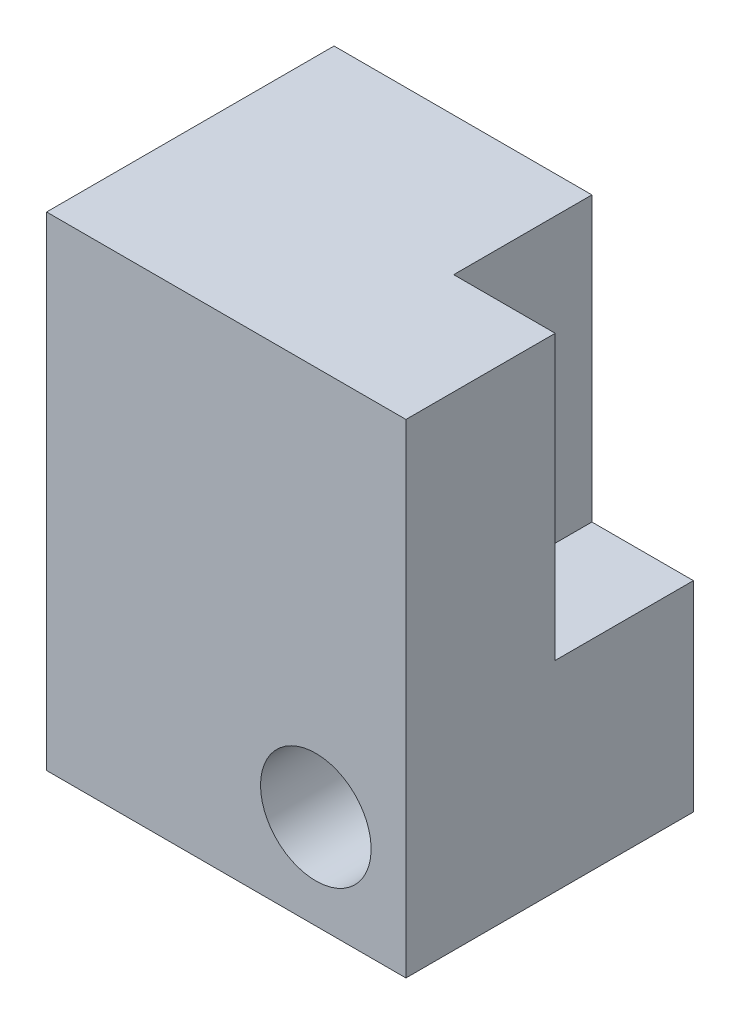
ISO-10303-21;
HEADER;
FILE_DESCRIPTION(('STEP AP214'),'2;1');
FILE_NAME('part.step','',(''),(''),'','','');
FILE_SCHEMA(('AUTOMOTIVE_DESIGN { 1 0 10303 214 1 1 1 1 }'));
ENDSEC;
DATA;
#1=APPLICATION_CONTEXT('core data for automotive mechanical design processes');
#2=APPLICATION_PROTOCOL_DEFINITION('international standard','automotive_design',2000,#1);
#3=PRODUCT_CONTEXT('',#1,'mechanical');
#4=PRODUCT('Part','Part','',(#3));
#5=PRODUCT_RELATED_PRODUCT_CATEGORY('part','',(#4));
#6=PRODUCT_DEFINITION_FORMATION('','',#4);
#7=PRODUCT_DEFINITION_CONTEXT('part definition',#1,'design');
#8=PRODUCT_DEFINITION('design','',#6,#7);
#9=PRODUCT_DEFINITION_SHAPE('','',#8);
#10=(LENGTH_UNIT() NAMED_UNIT(*) SI_UNIT(.MILLI.,.METRE.));
#11=(NAMED_UNIT(*) PLANE_ANGLE_UNIT() SI_UNIT($,.RADIAN.));
#12=(NAMED_UNIT(*) SI_UNIT($,.STERADIAN.) SOLID_ANGLE_UNIT());
#13=UNCERTAINTY_MEASURE_WITH_UNIT(LENGTH_MEASURE(1.E-05),#10,'distance_accuracy_value','');
#14=(GEOMETRIC_REPRESENTATION_CONTEXT(3) GLOBAL_UNCERTAINTY_ASSIGNED_CONTEXT((#13)) GLOBAL_UNIT_ASSIGNED_CONTEXT((#10,
#11,#12)) REPRESENTATION_CONTEXT('',''));
#15=CARTESIAN_POINT('',(0.,0.,0.));
#16=DIRECTION('',(0.,0.,1.));
#17=DIRECTION('',(1.,0.,0.));
#18=AXIS2_PLACEMENT_3D('',#15,#16,#17);
#19=CARTESIAN_POINT('',(0.,0.,104.));
#20=DIRECTION('',(0.,0.,1.));
#21=DIRECTION('',(1.,0.,0.));
#22=AXIS2_PLACEMENT_3D('',#19,#20,#21);
#23=PLANE('',#22);
#24=DIRECTION('',(0.,-1.,0.));
#25=VECTOR('',#24,1.);
#26=CARTESIAN_POINT('',(-130.,-175.,104.));
#27=LINE('',#26,#25);
#28=CARTESIAN_POINT('',(-130.,175.,104.));
#29=VERTEX_POINT('',#28);
#30=CARTESIAN_POINT('',(-130.,-175.,104.));
#31=VERTEX_POINT('',#30);
#32=EDGE_CURVE('E127',#29,#31,#27,.T.);
#33=ORIENTED_EDGE('',*,*,#32,.T.);
#34=DIRECTION('',(1.,0.,0.));
#35=VECTOR('',#34,1.);
#36=CARTESIAN_POINT('',(130.,-175.,104.));
#37=LINE('',#36,#35);
#38=CARTESIAN_POINT('',(130.,-175.,104.));
#39=VERTEX_POINT('',#38);
#40=EDGE_CURVE('E82',#31,#39,#37,.T.);
#41=ORIENTED_EDGE('',*,*,#40,.T.);
#42=DIRECTION('',(0.,1.,0.));
#43=VECTOR('',#42,1.);
#44=CARTESIAN_POINT('',(130.,-175.,104.));
#45=LINE('',#44,#43);
#46=CARTESIAN_POINT('',(130.,175.,104.));
#47=VERTEX_POINT('',#46);
#48=EDGE_CURVE('E140',#39,#47,#45,.T.);
#49=ORIENTED_EDGE('',*,*,#48,.T.);
#50=DIRECTION('',(-1.,0.,0.));
#51=VECTOR('',#50,1.);
#52=CARTESIAN_POINT('',(130.,175.,104.));
#53=LINE('',#52,#51);
#54=EDGE_CURVE('E58',#47,#29,#53,.T.);
#55=ORIENTED_EDGE('',*,*,#54,.T.);
#56=EDGE_LOOP('',(#33,#41,#49,#55));
#57=FACE_BOUND('',#56,.T.);
#58=CARTESIAN_POINT('',(64.7903211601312,-106.77508673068,104.));
#59=DIRECTION('',(0.,0.,1.));
#60=DIRECTION('',(1.,0.,0.));
#61=AXIS2_PLACEMENT_3D('',#58,#59,#60);
#62=CIRCLE('',#61,40.);
#63=CARTESIAN_POINT('',(24.7903211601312,-106.77508673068,104.));
#64=VERTEX_POINT('',#63);
#65=EDGE_CURVE('E147',#64,#64,#62,.T.);
#66=ORIENTED_EDGE('',*,*,#65,.F.);
#67=EDGE_LOOP('',(#66));
#68=FACE_BOUND('',#67,.T.);
#69=ADVANCED_FACE('F34',(#57,#68),#23,.T.);
#70=CARTESIAN_POINT('',(0.,0.,-104.));
#71=DIRECTION('',(0.,0.,1.));
#72=DIRECTION('',(1.,0.,0.));
#73=AXIS2_PLACEMENT_3D('',#70,#71,#72);
#74=PLANE('',#73);
#75=DIRECTION('',(-1.,0.,0.));
#76=VECTOR('',#75,1.);
#77=CARTESIAN_POINT('',(130.,175.,-104.));
#78=LINE('',#77,#76);
#79=CARTESIAN_POINT('',(56.5603151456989,175.,-104.));
#80=VERTEX_POINT('',#79);
#81=CARTESIAN_POINT('',(-130.,175.,-104.));
#82=VERTEX_POINT('',#81);
#83=EDGE_CURVE('E75',#80,#82,#78,.T.);
#84=ORIENTED_EDGE('',*,*,#83,.F.);
#85=DIRECTION('',(0.,1.,0.));
#86=VECTOR('',#85,1.);
#87=CARTESIAN_POINT('',(56.560315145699,-30.0000000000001,-104.));
#88=LINE('',#87,#86);
#89=CARTESIAN_POINT('',(56.560315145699,-30.0000000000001,-104.));
#90=VERTEX_POINT('',#89);
#91=EDGE_CURVE('E49',#90,#80,#88,.T.);
#92=ORIENTED_EDGE('',*,*,#91,.F.);
#93=DIRECTION('',(-1.,0.,0.));
#94=VECTOR('',#93,1.);
#95=CARTESIAN_POINT('',(130.,-30.0000000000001,-104.));
#96=LINE('',#95,#94);
#97=CARTESIAN_POINT('',(130.,-30.0000000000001,-104.));
#98=VERTEX_POINT('',#97);
#99=EDGE_CURVE('E107',#98,#90,#96,.T.);
#100=ORIENTED_EDGE('',*,*,#99,.F.);
#101=DIRECTION('',(0.,1.,0.));
#102=VECTOR('',#101,1.);
#103=CARTESIAN_POINT('',(130.,-175.,-104.));
#104=LINE('',#103,#102);
#105=CARTESIAN_POINT('',(130.,-175.,-104.));
#106=VERTEX_POINT('',#105);
#107=EDGE_CURVE('E119',#106,#98,#104,.T.);
#108=ORIENTED_EDGE('',*,*,#107,.F.);
#109=DIRECTION('',(1.,0.,0.));
#110=VECTOR('',#109,1.);
#111=CARTESIAN_POINT('',(130.,-175.,-104.));
#112=LINE('',#111,#110);
#113=CARTESIAN_POINT('',(-130.,-175.,-104.));
#114=VERTEX_POINT('',#113);
#115=EDGE_CURVE('E125',#114,#106,#112,.T.);
#116=ORIENTED_EDGE('',*,*,#115,.F.);
#117=DIRECTION('',(0.,-1.,0.));
#118=VECTOR('',#117,1.);
#119=CARTESIAN_POINT('',(-130.,-175.,-104.));
#120=LINE('',#119,#118);
#121=EDGE_CURVE('E129',#82,#114,#120,.T.);
#122=ORIENTED_EDGE('',*,*,#121,.F.);
#123=EDGE_LOOP('',(#84,#92,#100,#108,#116,#122));
#124=FACE_BOUND('',#123,.T.);
#125=CARTESIAN_POINT('',(64.7903211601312,-106.77508673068,-104.));
#126=DIRECTION('',(0.,0.,1.));
#127=DIRECTION('',(1.,0.,0.));
#128=AXIS2_PLACEMENT_3D('',#125,#126,#127);
#129=CIRCLE('',#128,40.);
#130=CARTESIAN_POINT('',(24.7903211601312,-106.77508673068,-104.));
#131=VERTEX_POINT('',#130);
#132=EDGE_CURVE('E143',#131,#131,#129,.T.);
#133=ORIENTED_EDGE('',*,*,#132,.T.);
#134=EDGE_LOOP('',(#133));
#135=FACE_BOUND('',#134,.T.);
#136=ADVANCED_FACE('F117',(#124,#135),#74,.F.);
#137=CARTESIAN_POINT('',(-130.,-175.,104.));
#138=DIRECTION('',(1.,0.,0.));
#139=DIRECTION('',(0.,0.,-1.));
#140=AXIS2_PLACEMENT_3D('',#137,#138,#139);
#141=PLANE('',#140);
#142=ORIENTED_EDGE('',*,*,#121,.T.);
#143=DIRECTION('',(0.,0.,-1.));
#144=VECTOR('',#143,1.);
#145=CARTESIAN_POINT('',(-130.,-175.,104.));
#146=LINE('',#145,#144);
#147=EDGE_CURVE('E11',#31,#114,#146,.T.);
#148=ORIENTED_EDGE('',*,*,#147,.F.);
#149=ORIENTED_EDGE('',*,*,#32,.F.);
#150=DIRECTION('',(0.,0.,-1.));
#151=VECTOR('',#150,1.);
#152=CARTESIAN_POINT('',(-130.,175.,104.));
#153=LINE('',#152,#151);
#154=EDGE_CURVE('E133',#29,#82,#153,.T.);
#155=ORIENTED_EDGE('',*,*,#154,.T.);
#156=EDGE_LOOP('',(#142,#148,#149,#155));
#157=FACE_BOUND('',#156,.T.);
#158=ADVANCED_FACE('F36',(#157),#141,.F.);
#159=CARTESIAN_POINT('',(130.,-175.,104.));
#160=DIRECTION('',(0.,1.,0.));
#161=DIRECTION('',(-1.,0.,0.));
#162=AXIS2_PLACEMENT_3D('',#159,#160,#161);
#163=PLANE('',#162);
#164=ORIENTED_EDGE('',*,*,#115,.T.);
#165=DIRECTION('',(0.,0.,-1.));
#166=VECTOR('',#165,1.);
#167=CARTESIAN_POINT('',(130.,-175.,104.));
#168=LINE('',#167,#166);
#169=EDGE_CURVE('E42',#39,#106,#168,.T.);
#170=ORIENTED_EDGE('',*,*,#169,.F.);
#171=ORIENTED_EDGE('',*,*,#40,.F.);
#172=ORIENTED_EDGE('',*,*,#147,.T.);
#173=EDGE_LOOP('',(#164,#170,#171,#172));
#174=FACE_BOUND('',#173,.T.);
#175=ADVANCED_FACE('F164',(#174),#163,.F.);
#176=CARTESIAN_POINT('',(130.,-175.,104.));
#177=DIRECTION('',(-1.,0.,0.));
#178=DIRECTION('',(0.,0.,1.));
#179=AXIS2_PLACEMENT_3D('',#176,#177,#178);
#180=PLANE('',#179);
#181=DIRECTION('',(0.,0.,-1.));
#182=VECTOR('',#181,1.);
#183=CARTESIAN_POINT('',(130.,-30.0000000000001,-104.));
#184=LINE('',#183,#182);
#185=CARTESIAN_POINT('',(130.,-30.0000000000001,-3.99999999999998));
#186=VERTEX_POINT('',#185);
#187=EDGE_CURVE('E103',#186,#98,#184,.T.);
#188=ORIENTED_EDGE('',*,*,#187,.F.);
#189=DIRECTION('',(0.,1.,0.));
#190=VECTOR('',#189,1.);
#191=CARTESIAN_POINT('',(130.,-30.0000000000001,-3.99999999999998));
#192=LINE('',#191,#190);
#193=CARTESIAN_POINT('',(130.,175.,-3.99999999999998));
#194=VERTEX_POINT('',#193);
#195=EDGE_CURVE('E141',#186,#194,#192,.T.);
#196=ORIENTED_EDGE('',*,*,#195,.T.);
#197=DIRECTION('',(0.,0.,-1.));
#198=VECTOR('',#197,1.);
#199=CARTESIAN_POINT('',(130.,175.,104.));
#200=LINE('',#199,#198);
#201=EDGE_CURVE('E135',#47,#194,#200,.T.);
#202=ORIENTED_EDGE('',*,*,#201,.F.);
#203=ORIENTED_EDGE('',*,*,#48,.F.);
#204=ORIENTED_EDGE('',*,*,#169,.T.);
#205=ORIENTED_EDGE('',*,*,#107,.T.);
#206=EDGE_LOOP('',(#188,#196,#202,#203,#204,#205));
#207=FACE_BOUND('',#206,.T.);
#208=ADVANCED_FACE('F123',(#207),#180,.F.);
#209=CARTESIAN_POINT('',(130.,175.,104.));
#210=DIRECTION('',(0.,-1.,0.));
#211=DIRECTION('',(1.,0.,0.));
#212=AXIS2_PLACEMENT_3D('',#209,#210,#211);
#213=PLANE('',#212);
#214=ORIENTED_EDGE('',*,*,#201,.T.);
#215=DIRECTION('',(1.,0.,0.));
#216=VECTOR('',#215,1.);
#217=CARTESIAN_POINT('',(130.,175.,-3.99999999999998));
#218=LINE('',#217,#216);
#219=CARTESIAN_POINT('',(56.5603151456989,175.,-3.99999999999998));
#220=VERTEX_POINT('',#219);
#221=EDGE_CURVE('E113',#220,#194,#218,.T.);
#222=ORIENTED_EDGE('',*,*,#221,.F.);
#223=DIRECTION('',(0.,0.,1.));
#224=VECTOR('',#223,1.);
#225=CARTESIAN_POINT('',(56.5603151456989,175.,-104.));
#226=LINE('',#225,#224);
#227=EDGE_CURVE('E251',#80,#220,#226,.T.);
#228=ORIENTED_EDGE('',*,*,#227,.F.);
#229=ORIENTED_EDGE('',*,*,#83,.T.);
#230=ORIENTED_EDGE('',*,*,#154,.F.);
#231=ORIENTED_EDGE('',*,*,#54,.F.);
#232=EDGE_LOOP('',(#214,#222,#228,#229,#230,#231));
#233=FACE_BOUND('',#232,.T.);
#234=ADVANCED_FACE('F139',(#233),#213,.F.);
#235=CARTESIAN_POINT('',(64.7903211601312,-106.77508673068,104.));
#236=DIRECTION('',(0.,0.,-1.));
#237=DIRECTION('',(-1.,0.,0.));
#238=AXIS2_PLACEMENT_3D('',#235,#236,#237);
#239=CYLINDRICAL_SURFACE('',#238,40.);
#240=CARTESIAN_POINT('',(24.7903211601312,-106.77508673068,104.));
#241=CARTESIAN_POINT('',(24.7903211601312,-106.77508673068,101.833333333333));
#242=CARTESIAN_POINT('',(24.7903211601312,-106.77508673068,99.6666666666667));
#243=CARTESIAN_POINT('',(24.7903211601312,-106.77508673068,95.3333333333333));
#244=CARTESIAN_POINT('',(24.7903211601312,-106.77508673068,93.1666666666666));
#245=CARTESIAN_POINT('',(24.7903211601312,-106.77508673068,88.8333333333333));
#246=CARTESIAN_POINT('',(24.7903211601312,-106.77508673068,86.6666666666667));
#247=CARTESIAN_POINT('',(24.7903211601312,-106.77508673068,82.3333333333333));
#248=CARTESIAN_POINT('',(24.7903211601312,-106.77508673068,80.1666666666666));
#249=CARTESIAN_POINT('',(24.7903211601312,-106.77508673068,75.8333333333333));
#250=CARTESIAN_POINT('',(24.7903211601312,-106.77508673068,73.6666666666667));
#251=CARTESIAN_POINT('',(24.7903211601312,-106.77508673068,69.3333333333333));
#252=CARTESIAN_POINT('',(24.7903211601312,-106.77508673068,67.1666666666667));
#253=CARTESIAN_POINT('',(24.7903211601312,-106.77508673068,62.8333333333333));
#254=CARTESIAN_POINT('',(24.7903211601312,-106.77508673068,60.6666666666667));
#255=CARTESIAN_POINT('',(24.7903211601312,-106.77508673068,56.3333333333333));
#256=CARTESIAN_POINT('',(24.7903211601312,-106.77508673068,54.1666666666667));
#257=CARTESIAN_POINT('',(24.7903211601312,-106.77508673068,49.8333333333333));
#258=CARTESIAN_POINT('',(24.7903211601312,-106.77508673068,47.6666666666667));
#259=CARTESIAN_POINT('',(24.7903211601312,-106.77508673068,43.3333333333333));
#260=CARTESIAN_POINT('',(24.7903211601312,-106.77508673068,41.1666666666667));
#261=CARTESIAN_POINT('',(24.7903211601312,-106.77508673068,36.8333333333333));
#262=CARTESIAN_POINT('',(24.7903211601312,-106.77508673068,34.6666666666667));
#263=CARTESIAN_POINT('',(24.7903211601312,-106.77508673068,30.3333333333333));
#264=CARTESIAN_POINT('',(24.7903211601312,-106.77508673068,28.1666666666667));
#265=CARTESIAN_POINT('',(24.7903211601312,-106.77508673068,23.8333333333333));
#266=CARTESIAN_POINT('',(24.7903211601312,-106.77508673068,21.6666666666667));
#267=CARTESIAN_POINT('',(24.7903211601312,-106.77508673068,17.3333333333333));
#268=CARTESIAN_POINT('',(24.7903211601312,-106.77508673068,15.1666666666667));
#269=CARTESIAN_POINT('',(24.7903211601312,-106.77508673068,10.8333333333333));
#270=CARTESIAN_POINT('',(24.7903211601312,-106.77508673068,8.66666666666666));
#271=CARTESIAN_POINT('',(24.7903211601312,-106.77508673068,4.33333333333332));
#272=CARTESIAN_POINT('',(24.7903211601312,-106.77508673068,2.16666666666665));
#273=CARTESIAN_POINT('',(24.7903211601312,-106.77508673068,-2.16666666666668));
#274=CARTESIAN_POINT('',(24.7903211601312,-106.77508673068,-4.33333333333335));
#275=CARTESIAN_POINT('',(24.7903211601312,-106.77508673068,-8.66666666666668));
#276=CARTESIAN_POINT('',(24.7903211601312,-106.77508673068,-10.8333333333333));
#277=CARTESIAN_POINT('',(24.7903211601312,-106.77508673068,-15.1666666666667));
#278=CARTESIAN_POINT('',(24.7903211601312,-106.77508673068,-17.3333333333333));
#279=CARTESIAN_POINT('',(24.7903211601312,-106.77508673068,-21.6666666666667));
#280=CARTESIAN_POINT('',(24.7903211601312,-106.77508673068,-23.8333333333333));
#281=CARTESIAN_POINT('',(24.7903211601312,-106.77508673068,-28.1666666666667));
#282=CARTESIAN_POINT('',(24.7903211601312,-106.77508673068,-30.3333333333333));
#283=CARTESIAN_POINT('',(24.7903211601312,-106.77508673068,-34.6666666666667));
#284=CARTESIAN_POINT('',(24.7903211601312,-106.77508673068,-36.8333333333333));
#285=CARTESIAN_POINT('',(24.7903211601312,-106.77508673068,-41.1666666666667));
#286=CARTESIAN_POINT('',(24.7903211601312,-106.77508673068,-43.3333333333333));
#287=CARTESIAN_POINT('',(24.7903211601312,-106.77508673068,-47.6666666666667));
#288=CARTESIAN_POINT('',(24.7903211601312,-106.77508673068,-49.8333333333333));
#289=CARTESIAN_POINT('',(24.7903211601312,-106.77508673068,-54.1666666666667));
#290=CARTESIAN_POINT('',(24.7903211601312,-106.77508673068,-56.3333333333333));
#291=CARTESIAN_POINT('',(24.7903211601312,-106.77508673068,-60.6666666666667));
#292=CARTESIAN_POINT('',(24.7903211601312,-106.77508673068,-62.8333333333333));
#293=CARTESIAN_POINT('',(24.7903211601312,-106.77508673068,-67.1666666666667));
#294=CARTESIAN_POINT('',(24.7903211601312,-106.77508673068,-69.3333333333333));
#295=CARTESIAN_POINT('',(24.7903211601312,-106.77508673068,-73.6666666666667));
#296=CARTESIAN_POINT('',(24.7903211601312,-106.77508673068,-75.8333333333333));
#297=CARTESIAN_POINT('',(24.7903211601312,-106.77508673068,-80.1666666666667));
#298=CARTESIAN_POINT('',(24.7903211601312,-106.77508673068,-82.3333333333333));
#299=CARTESIAN_POINT('',(24.7903211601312,-106.77508673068,-86.6666666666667));
#300=CARTESIAN_POINT('',(24.7903211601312,-106.77508673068,-88.8333333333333));
#301=CARTESIAN_POINT('',(24.7903211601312,-106.77508673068,-93.1666666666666));
#302=CARTESIAN_POINT('',(24.7903211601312,-106.77508673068,-95.3333333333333));
#303=CARTESIAN_POINT('',(24.7903211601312,-106.77508673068,-99.6666666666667));
#304=CARTESIAN_POINT('',(24.7903211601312,-106.77508673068,-101.833333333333));
#305=CARTESIAN_POINT('',(24.7903211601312,-106.77508673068,-104.));
#306=B_SPLINE_CURVE_WITH_KNOTS('',3,(#240,#241,#242,#243,#244,#245,#246,#247,#248,#249,#250,
#251,#252,#253,#254,#255,#256,#257,#258,#259,#260,#261,#262,#263,#264,#265,#266,#267,#268,#269,
#270,#271,#272,#273,#274,#275,#276,#277,#278,#279,#280,#281,#282,#283,#284,#285,#286,#287,#288,
#289,#290,#291,#292,#293,#294,#295,#296,#297,#298,#299,#300,#301,#302,#303,#304,#305),
.UNSPECIFIED.,.F.,.F.,(4,2,2,2,2,2,2,2,2,2,2,2,2,2,2,2,2,2,2,2,2,2,2,2,2,2,2,2,2,2,2,2,4),(0.,
6.49999999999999,13.,19.5,26.,32.5,39.,45.5,52.,58.5,65.,71.5,78.,84.5,91.,97.5,104.,110.5,117.,
123.5,130.,136.5,143.,149.5,156.,162.5,169.,175.5,182.,188.5,195.,201.5,208.),.UNSPECIFIED.);
#307=EDGE_CURVE('BSEAM179',#64,#131,#306,.T.);
#308=ORIENTED_EDGE('',*,*,#65,.T.);
#309=ORIENTED_EDGE('',*,*,#132,.F.);
#310=ORIENTED_EDGE('',*,*,#307,.T.);
#311=ORIENTED_EDGE('',*,*,#307,.F.);
#312=EDGE_LOOP('',(#308,#310,#309,#311));
#313=FACE_BOUND('',#312,.T.);
#314=ADVANCED_FACE('F179',(#313),#239,.F.);
#315=CARTESIAN_POINT('',(130.,-30.0000000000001,-3.99999999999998));
#316=DIRECTION('',(0.,0.,1.));
#317=DIRECTION('',(1.,0.,0.));
#318=AXIS2_PLACEMENT_3D('',#315,#316,#317);
#319=PLANE('',#318);
#320=ORIENTED_EDGE('',*,*,#221,.T.);
#321=ORIENTED_EDGE('',*,*,#195,.F.);
#322=DIRECTION('',(1.,0.,0.));
#323=VECTOR('',#322,1.);
#324=CARTESIAN_POINT('',(130.,-30.0000000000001,-3.99999999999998));
#325=LINE('',#324,#323);
#326=CARTESIAN_POINT('',(56.560315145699,-30.0000000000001,-3.99999999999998));
#327=VERTEX_POINT('',#326);
#328=EDGE_CURVE('E109',#327,#186,#325,.T.);
#329=ORIENTED_EDGE('',*,*,#328,.F.);
#330=DIRECTION('',(0.,1.,0.));
#331=VECTOR('',#330,1.);
#332=CARTESIAN_POINT('',(56.560315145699,-30.0000000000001,-3.99999999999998));
#333=LINE('',#332,#331);
#334=EDGE_CURVE('E144',#327,#220,#333,.T.);
#335=ORIENTED_EDGE('',*,*,#334,.T.);
#336=EDGE_LOOP('',(#320,#321,#329,#335));
#337=FACE_BOUND('',#336,.T.);
#338=ADVANCED_FACE('F186',(#337),#319,.F.);
#339=CARTESIAN_POINT('',(56.560315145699,-30.0000000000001,-104.));
#340=DIRECTION('',(-1.,0.,0.));
#341=DIRECTION('',(0.,0.,1.));
#342=AXIS2_PLACEMENT_3D('',#339,#340,#341);
#343=PLANE('',#342);
#344=ORIENTED_EDGE('',*,*,#227,.T.);
#345=ORIENTED_EDGE('',*,*,#334,.F.);
#346=DIRECTION('',(0.,0.,1.));
#347=VECTOR('',#346,1.);
#348=CARTESIAN_POINT('',(56.560315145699,-30.0000000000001,-104.));
#349=LINE('',#348,#347);
#350=EDGE_CURVE('E120',#90,#327,#349,.T.);
#351=ORIENTED_EDGE('',*,*,#350,.F.);
#352=ORIENTED_EDGE('',*,*,#91,.T.);
#353=EDGE_LOOP('',(#344,#345,#351,#352));
#354=FACE_BOUND('',#353,.T.);
#355=ADVANCED_FACE('F191',(#354),#343,.F.);
#356=CARTESIAN_POINT('',(0.,-30.0000000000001,0.));
#357=DIRECTION('',(0.,-1.,0.));
#358=DIRECTION('',(0.,0.,-1.));
#359=AXIS2_PLACEMENT_3D('',#356,#357,#358);
#360=PLANE('',#359);
#361=ORIENTED_EDGE('',*,*,#187,.T.);
#362=ORIENTED_EDGE('',*,*,#99,.T.);
#363=ORIENTED_EDGE('',*,*,#350,.T.);
#364=ORIENTED_EDGE('',*,*,#328,.T.);
#365=EDGE_LOOP('',(#361,#362,#363,#364));
#366=FACE_BOUND('',#365,.T.);
#367=ADVANCED_FACE('F105',(#366),#360,.F.);
#368=CLOSED_SHELL('',(#69,#136,#158,#175,#208,#234,#314,#338,#355,#367));
#369=MANIFOLD_SOLID_BREP('B2',#368);
#370=ADVANCED_BREP_SHAPE_REPRESENTATION('',(#18,#369),#14);
#371=SHAPE_DEFINITION_REPRESENTATION(#9,#370);
ENDSEC;
END-ISO-10303-21;
